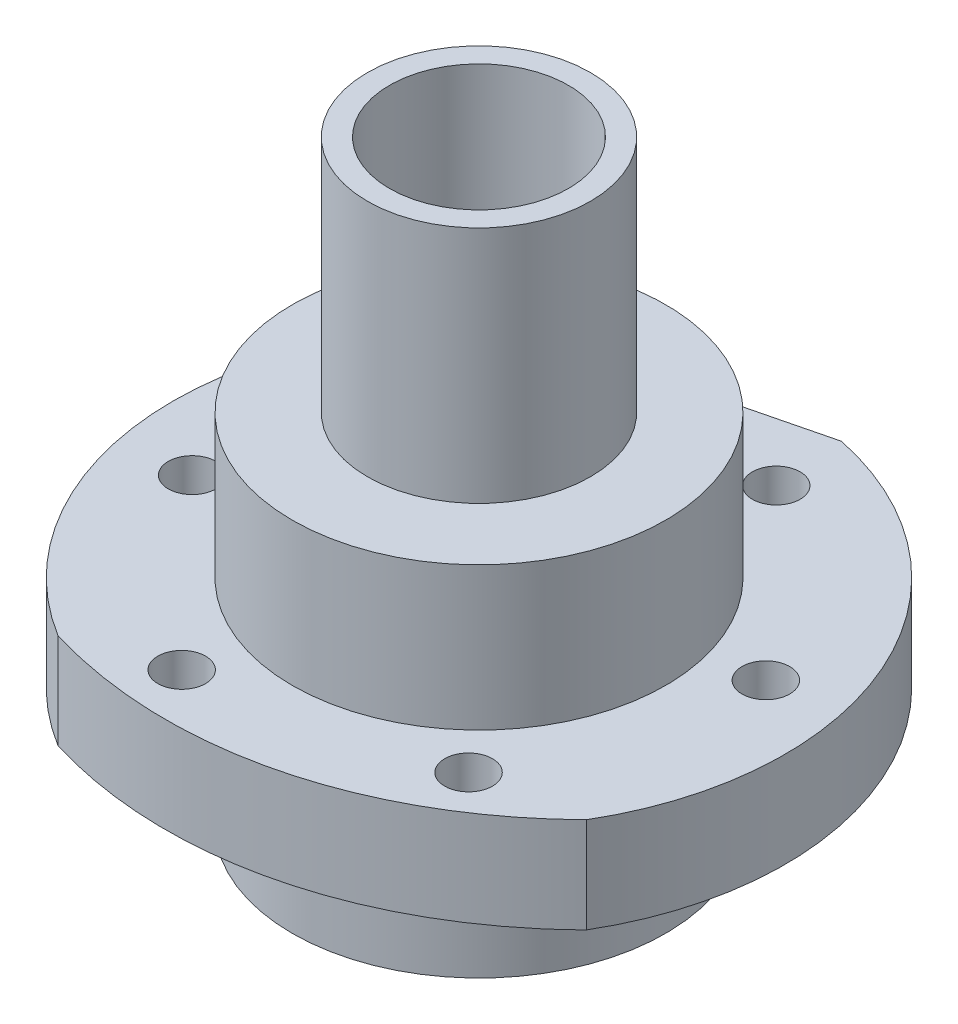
from build123d import *

# Parameters (mm, degrees)
CUT_EXTRUDE1_DEPTH = 8
SKETCH3_R          = 2
CUT_EXTRUDE2_DEPTH = 8


with BuildPart() as part:
    # Sketch1 → Revolve1 (revolve)
    with BuildSketch(Plane(origin=(0, 0, 0), x_dir=(0, 0, -1), z_dir=(1, 0, 0)), mode=Mode.PRIVATE) as revolve1_sk:
        with BuildLine():
            Line((12.65, 0), (15.65, 0))
            Line((15.65, 0), (15.65, 10))
            Line((15.65, 10), (25.65, 10))
            Line((25.65, 10), (25.65, 18))
            Line((25.65, 18), (15.65, 18))
            Line((15.65, 18), (15.65, 30))
            Line((15.65, 30), (9.35, 30))
            Line((9.35, 30), (9.35, 50))
            Line((9.35, 50), (7.5, 50))
            Line((7.5, 50), (7.5, 30))
            Line((7.5, 30), (7.5, 27))
            Line((7.5, 27), (12.65, 27))
            Line((12.65, 27), (12.65, 25))
            Line((12.65, 25), (12.95, 25))
            ThreePointArc((12.95, 25), (13.444974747, 24.794974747), (13.65, 24.3))
            Line((13.65, 24.3), (13.65, 22.7))
            ThreePointArc((13.65, 22.7), (13.444974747, 22.205025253), (12.95, 22))
            Line((12.95, 22), (12.65, 22))
            Line((12.65, 22), (12.65, 0))
        make_face()
    revolve(revolve1_sk.sketch.rotate(Axis((0, 30, 0), (0, -1, 0)), 180), axis=Axis((0, 30, 0), (0, -1, 0)))

    # Sketch2 → Cut-Extrude1 (cut)
    with BuildSketch(Plane(origin=(0, 18, 0), x_dir=(1, 0, 0), z_dir=(0, 1, 0))):
        with BuildLine():
            Line((-16.383639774, 19.735725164), (5.286345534, 25.099343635))
            ThreePointArc((5.286345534, 25.099343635), (-6.162757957, 24.898652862), (-16.383639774, 19.735725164))
        make_face()
        with BuildLine():
            ThreePointArc((-13.435030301, -21.849999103), (6.162757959, -24.898652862), (22.075873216, -13.060563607))
            add(Edge.make_bspline(
                [(-13.435030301, -21.849999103), (-12.354794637, -22.17606597), (-9.966355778, -22.783422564), (-6.219094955, -23.348657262), (-2.246540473, -23.505018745), (1.694803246, -23.217849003), (5.566526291, -22.489769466), (9.330860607, -21.327820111), (12.951114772, -19.743390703), (16.392090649, -17.752078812), (19.443064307, -15.504187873), (21.272448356, -13.85286228), (22.075873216, -13.060563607)],
                knots=[0.358219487, 0.358219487, 0.358219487, 0.358219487, 0.383188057, 0.412698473, 0.441949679, 0.471020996, 0.500000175, 0.528979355, 0.558050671, 0.587301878, 0.616812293, 0.641780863, 0.641780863, 0.641780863, 0.641780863], degree=3))
        make_face()
    extrude(amount=-CUT_EXTRUDE1_DEPTH, mode=Mode.SUBTRACT)

    # Sketch3 → Cut-Extrude2 (cut)
    with BuildSketch(Plane(origin=(0, 18, 0), x_dir=(1, 0, 0), z_dir=(0, 1, 0))):
        with Locations(Location((-5.770478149, -19.149453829, 0), (0, 0, 270))):
            Circle(SKETCH3_R)
        with Locations(Location((13.69867441, -14.572107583, 0), (0, 0, 270))):
            Circle(SKETCH3_R)
        with Locations(Location((19.469152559, 4.577346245, 0), (0, 0, 270))):
            Circle(SKETCH3_R)
        with Locations(Location((5.770478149, 19.149453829, 0), (0, 0, 270))):
            Circle(SKETCH3_R)
        with Locations(Location((-19.469152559, -4.577346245, 0), (0, 0, 270))):
            Circle(SKETCH3_R)
        with Locations(Location((-13.69867441, 14.572107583, 0), (0, 0, 270))):
            Circle(SKETCH3_R)
    extrude(amount=-CUT_EXTRUDE2_DEPTH, mode=Mode.SUBTRACT)


solid = part.part
